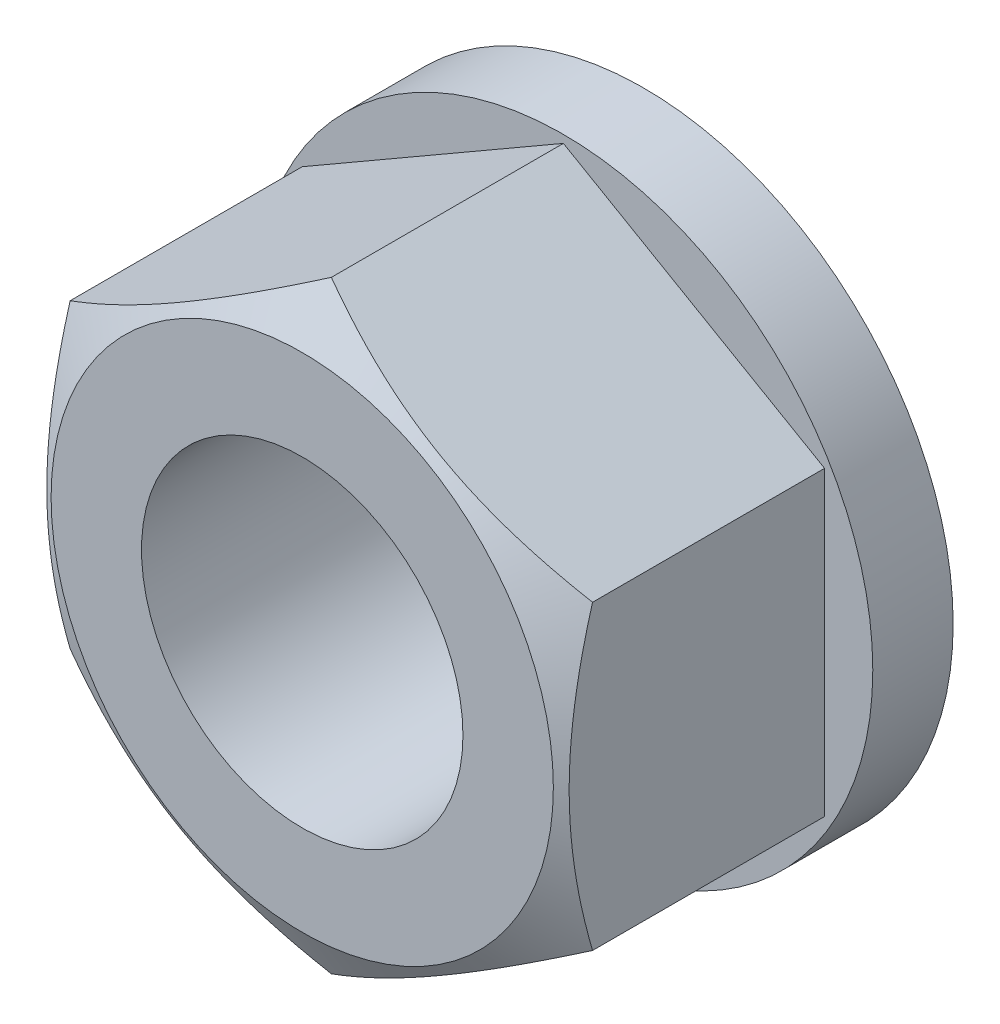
ISO-10303-21;
HEADER;
FILE_DESCRIPTION(('STEP AP214'),'2;1');
FILE_NAME('part.step','',(''),(''),'','','');
FILE_SCHEMA(('AUTOMOTIVE_DESIGN { 1 0 10303 214 1 1 1 1 }'));
ENDSEC;
DATA;
#1=APPLICATION_CONTEXT('core data for automotive mechanical design processes');
#2=APPLICATION_PROTOCOL_DEFINITION('international standard','automotive_design',2000,#1);
#3=PRODUCT_CONTEXT('',#1,'mechanical');
#4=PRODUCT('Part','Part','',(#3));
#5=PRODUCT_RELATED_PRODUCT_CATEGORY('part','',(#4));
#6=PRODUCT_DEFINITION_FORMATION('','',#4);
#7=PRODUCT_DEFINITION_CONTEXT('part definition',#1,'design');
#8=PRODUCT_DEFINITION('design','',#6,#7);
#9=PRODUCT_DEFINITION_SHAPE('','',#8);
#10=(LENGTH_UNIT() NAMED_UNIT(*) SI_UNIT(.MILLI.,.METRE.));
#11=(NAMED_UNIT(*) PLANE_ANGLE_UNIT() SI_UNIT($,.RADIAN.));
#12=(NAMED_UNIT(*) SI_UNIT($,.STERADIAN.) SOLID_ANGLE_UNIT());
#13=UNCERTAINTY_MEASURE_WITH_UNIT(LENGTH_MEASURE(1.E-05),#10,'distance_accuracy_value','');
#14=(GEOMETRIC_REPRESENTATION_CONTEXT(3) GLOBAL_UNCERTAINTY_ASSIGNED_CONTEXT((#13)) GLOBAL_UNIT_ASSIGNED_CONTEXT((#10,
#11,#12)) REPRESENTATION_CONTEXT('',''));
#15=CARTESIAN_POINT('',(0.,0.,0.));
#16=DIRECTION('',(0.,0.,1.));
#17=DIRECTION('',(1.,0.,0.));
#18=AXIS2_PLACEMENT_3D('',#15,#16,#17);
#19=CARTESIAN_POINT('',(0.,0.,2.));
#20=DIRECTION('',(0.,0.,1.));
#21=DIRECTION('',(1.,0.,0.));
#22=AXIS2_PLACEMENT_3D('',#19,#20,#21);
#23=PLANE('',#22);
#24=CARTESIAN_POINT('',(0.,0.,2.));
#25=DIRECTION('',(0.,0.,1.));
#26=DIRECTION('',(1.,0.,0.));
#27=AXIS2_PLACEMENT_3D('',#24,#25,#26);
#28=CIRCLE('',#27,7.7);
#29=CARTESIAN_POINT('',(7.7,0.,2.));
#30=VERTEX_POINT('',#29);
#31=EDGE_CURVE('E28',#30,#30,#28,.T.);
#32=ORIENTED_EDGE('',*,*,#31,.T.);
#33=EDGE_LOOP('',(#32));
#34=FACE_BOUND('',#33,.T.);
#35=DIRECTION('',(-0.866025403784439,0.5,0.));
#36=VECTOR('',#35,1.);
#37=CARTESIAN_POINT('',(6.5,3.75277674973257,2.));
#38=LINE('',#37,#36);
#39=CARTESIAN_POINT('',(6.5,3.75277674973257,2.));
#40=VERTEX_POINT('',#39);
#41=CARTESIAN_POINT('',(0.,7.50555349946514,2.));
#42=VERTEX_POINT('',#41);
#43=EDGE_CURVE('E86',#40,#42,#38,.T.);
#44=ORIENTED_EDGE('',*,*,#43,.F.);
#45=DIRECTION('',(0.,1.,0.));
#46=VECTOR('',#45,1.);
#47=CARTESIAN_POINT('',(6.5,-3.75277674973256,2.));
#48=LINE('',#47,#46);
#49=CARTESIAN_POINT('',(6.5,-3.75277674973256,2.));
#50=VERTEX_POINT('',#49);
#51=EDGE_CURVE('E305',#50,#40,#48,.T.);
#52=ORIENTED_EDGE('',*,*,#51,.F.);
#53=DIRECTION('',(0.866025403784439,0.5,0.));
#54=VECTOR('',#53,1.);
#55=CARTESIAN_POINT('',(0.,-7.50555349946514,2.));
#56=LINE('',#55,#54);
#57=CARTESIAN_POINT('',(0.,-7.50555349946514,2.));
#58=VERTEX_POINT('',#57);
#59=EDGE_CURVE('E302',#58,#50,#56,.T.);
#60=ORIENTED_EDGE('',*,*,#59,.F.);
#61=DIRECTION('',(0.866025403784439,-0.5,0.));
#62=VECTOR('',#61,1.);
#63=CARTESIAN_POINT('',(-6.5,-3.75277674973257,2.));
#64=LINE('',#63,#62);
#65=CARTESIAN_POINT('',(-6.5,-3.75277674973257,2.));
#66=VERTEX_POINT('',#65);
#67=EDGE_CURVE('E299',#66,#58,#64,.T.);
#68=ORIENTED_EDGE('',*,*,#67,.F.);
#69=DIRECTION('',(0.,-1.,0.));
#70=VECTOR('',#69,1.);
#71=CARTESIAN_POINT('',(-6.5,3.75277674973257,2.));
#72=LINE('',#71,#70);
#73=CARTESIAN_POINT('',(-6.5,3.75277674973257,2.));
#74=VERTEX_POINT('',#73);
#75=EDGE_CURVE('E296',#74,#66,#72,.T.);
#76=ORIENTED_EDGE('',*,*,#75,.F.);
#77=DIRECTION('',(-0.866025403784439,-0.5,0.));
#78=VECTOR('',#77,1.);
#79=CARTESIAN_POINT('',(0.,7.50555349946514,2.));
#80=LINE('',#79,#78);
#81=EDGE_CURVE('E294',#42,#74,#80,.T.);
#82=ORIENTED_EDGE('',*,*,#81,.F.);
#83=EDGE_LOOP('',(#44,#52,#60,#68,#76,#82));
#84=FACE_BOUND('',#83,.T.);
#85=ADVANCED_FACE('F14',(#34,#84),#23,.T.);
#86=CARTESIAN_POINT('',(0.,0.,0.));
#87=DIRECTION('',(0.,0.,1.));
#88=DIRECTION('',(1.,0.,0.));
#89=AXIS2_PLACEMENT_3D('',#86,#87,#88);
#90=PLANE('',#89);
#91=CARTESIAN_POINT('',(0.,0.,0.));
#92=DIRECTION('',(0.,0.,1.));
#93=DIRECTION('',(1.,0.,0.));
#94=AXIS2_PLACEMENT_3D('',#91,#92,#93);
#95=CIRCLE('',#94,7.7);
#96=CARTESIAN_POINT('',(7.7,0.,0.));
#97=VERTEX_POINT('',#96);
#98=EDGE_CURVE('E103',#97,#97,#95,.T.);
#99=ORIENTED_EDGE('',*,*,#98,.F.);
#100=EDGE_LOOP('',(#99));
#101=FACE_BOUND('',#100,.T.);
#102=CARTESIAN_POINT('',(0.,0.,0.));
#103=DIRECTION('',(0.,0.,1.));
#104=DIRECTION('',(1.,0.,0.));
#105=AXIS2_PLACEMENT_3D('',#102,#103,#104);
#106=CIRCLE('',#105,4.1);
#107=CARTESIAN_POINT('',(4.1,0.,0.));
#108=VERTEX_POINT('',#107);
#109=EDGE_CURVE('E100',#108,#108,#106,.T.);
#110=ORIENTED_EDGE('',*,*,#109,.T.);
#111=EDGE_LOOP('',(#110));
#112=FACE_BOUND('',#111,.T.);
#113=ADVANCED_FACE('F115',(#101,#112),#90,.F.);
#114=CARTESIAN_POINT('',(0.,0.,2.));
#115=DIRECTION('',(0.,0.,-1.));
#116=DIRECTION('',(-1.,0.,0.));
#117=AXIS2_PLACEMENT_3D('',#114,#115,#116);
#118=CYLINDRICAL_SURFACE('',#117,7.7);
#119=ORIENTED_EDGE('',*,*,#31,.F.);
#120=EDGE_LOOP('',(#119));
#121=FACE_BOUND('',#120,.T.);
#122=ORIENTED_EDGE('',*,*,#98,.T.);
#123=EDGE_LOOP('',(#122));
#124=FACE_BOUND('',#123,.T.);
#125=ADVANCED_FACE('F16',(#121,#124),#118,.T.);
#126=CARTESIAN_POINT('',(0.,0.,2.));
#127=DIRECTION('',(0.,0.,-1.));
#128=DIRECTION('',(-1.,0.,0.));
#129=AXIS2_PLACEMENT_3D('',#126,#127,#128);
#130=CYLINDRICAL_SURFACE('',#129,4.1);
#131=CARTESIAN_POINT('',(0.,0.,2.));
#132=DIRECTION('',(0.,0.,1.));
#133=DIRECTION('',(1.,0.,0.));
#134=AXIS2_PLACEMENT_3D('',#131,#132,#133);
#135=CIRCLE('',#134,4.1);
#136=CARTESIAN_POINT('',(4.1,0.,2.));
#137=VERTEX_POINT('',#136);
#138=EDGE_CURVE('E99',#137,#137,#135,.T.);
#139=ORIENTED_EDGE('',*,*,#138,.T.);
#140=EDGE_LOOP('',(#139));
#141=FACE_BOUND('',#140,.T.);
#142=ORIENTED_EDGE('',*,*,#109,.F.);
#143=EDGE_LOOP('',(#142));
#144=FACE_BOUND('',#143,.T.);
#145=ADVANCED_FACE('F114',(#141,#144),#130,.F.);
#146=CARTESIAN_POINT('',(-5.49926131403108,9.525,8.5));
#147=DIRECTION('',(0.,0.,1.));
#148=DIRECTION('',(1.,0.,0.));
#149=AXIS2_PLACEMENT_3D('',#146,#147,#148);
#150=PLANE('',#149);
#151=CARTESIAN_POINT('',(0.,0.,8.5));
#152=DIRECTION('',(0.,0.,-1.));
#153=DIRECTION('',(-1.,0.,0.));
#154=AXIS2_PLACEMENT_3D('',#151,#152,#153);
#155=CIRCLE('',#154,6.25);
#156=CARTESIAN_POINT('',(-6.25,0.,8.5));
#157=VERTEX_POINT('',#156);
#158=EDGE_CURVE('E82',#157,#157,#155,.T.);
#159=ORIENTED_EDGE('',*,*,#158,.F.);
#160=EDGE_LOOP('',(#159));
#161=FACE_BOUND('',#160,.T.);
#162=CARTESIAN_POINT('',(0.,0.,8.5));
#163=DIRECTION('',(0.,0.,1.));
#164=DIRECTION('',(1.,0.,0.));
#165=AXIS2_PLACEMENT_3D('',#162,#163,#164);
#166=CIRCLE('',#165,4.);
#167=CARTESIAN_POINT('',(4.,0.,8.5));
#168=VERTEX_POINT('',#167);
#169=EDGE_CURVE('E88',#168,#168,#166,.T.);
#170=ORIENTED_EDGE('',*,*,#169,.F.);
#171=EDGE_LOOP('',(#170));
#172=FACE_BOUND('',#171,.T.);
#173=ADVANCED_FACE('F124',(#161,#172),#150,.T.);
#174=CARTESIAN_POINT('',(-5.49926131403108,9.525,2.));
#175=DIRECTION('',(0.,0.,1.));
#176=DIRECTION('',(1.,0.,0.));
#177=AXIS2_PLACEMENT_3D('',#174,#175,#176);
#178=PLANE('',#177);
#179=CARTESIAN_POINT('',(0.,0.,2.));
#180=DIRECTION('',(0.,0.,1.));
#181=DIRECTION('',(1.,0.,0.));
#182=AXIS2_PLACEMENT_3D('',#179,#180,#181);
#183=CIRCLE('',#182,4.);
#184=CARTESIAN_POINT('',(4.,0.,2.));
#185=VERTEX_POINT('',#184);
#186=EDGE_CURVE('E91',#185,#185,#183,.T.);
#187=ORIENTED_EDGE('',*,*,#186,.T.);
#188=EDGE_LOOP('',(#187));
#189=FACE_BOUND('',#188,.T.);
#190=ORIENTED_EDGE('',*,*,#138,.F.);
#191=EDGE_LOOP('',(#190));
#192=FACE_BOUND('',#191,.T.);
#193=ADVANCED_FACE('F132',(#189,#192),#178,.F.);
#194=CARTESIAN_POINT('',(0.,0.,2.));
#195=DIRECTION('',(0.,0.,1.));
#196=DIRECTION('',(1.,0.,0.));
#197=AXIS2_PLACEMENT_3D('',#194,#195,#196);
#198=CYLINDRICAL_SURFACE('',#197,4.);
#199=ORIENTED_EDGE('',*,*,#186,.F.);
#200=EDGE_LOOP('',(#199));
#201=FACE_BOUND('',#200,.T.);
#202=ORIENTED_EDGE('',*,*,#169,.T.);
#203=EDGE_LOOP('',(#202));
#204=FACE_BOUND('',#203,.T.);
#205=ADVANCED_FACE('F172',(#201,#204),#198,.F.);
#206=CARTESIAN_POINT('',(6.5,-3.75277674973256,28.3578280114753));
#207=DIRECTION('',(-1.,0.,0.));
#208=DIRECTION('',(0.,0.,1.));
#209=AXIS2_PLACEMENT_3D('',#206,#207,#208);
#210=PLANE('',#209);
#211=DIRECTION('',(0.,0.,-1.));
#212=VECTOR('',#211,1.);
#213=CARTESIAN_POINT('',(6.5,3.75277674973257,28.3578280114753));
#214=LINE('',#213,#212);
#215=CARTESIAN_POINT('',(6.5,3.75277674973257,7.77510584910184));
#216=VERTEX_POINT('',#215);
#217=EDGE_CURVE('E41',#216,#40,#214,.T.);
#218=ORIENTED_EDGE('',*,*,#217,.F.);
#219=CARTESIAN_POINT('',(6.5,-10.0315093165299,5.20720308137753));
#220=CARTESIAN_POINT('',(6.5,-9.74801627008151,5.34452523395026));
#221=CARTESIAN_POINT('',(6.5,-9.46386715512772,5.48051644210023));
#222=CARTESIAN_POINT('',(6.5,-8.89390770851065,5.74908741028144));
#223=CARTESIAN_POINT('',(6.5,-8.608097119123,5.88166662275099));
#224=CARTESIAN_POINT('',(6.5,-8.0329694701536,6.14334153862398));
#225=CARTESIAN_POINT('',(6.5,-7.7436417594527,6.27241391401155));
#226=CARTESIAN_POINT('',(6.5,-7.16266788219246,6.52521072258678));
#227=CARTESIAN_POINT('',(6.5,-6.87102182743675,6.64893541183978));
#228=CARTESIAN_POINT('',(6.5,-6.27572812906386,6.89340953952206));
#229=CARTESIAN_POINT('',(6.5,-5.97199138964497,7.01394322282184));
#230=CARTESIAN_POINT('',(6.5,-5.36094607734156,7.24576901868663));
#231=CARTESIAN_POINT('',(6.5,-5.05363710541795,7.35706008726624));
#232=CARTESIAN_POINT('',(6.5,-4.43555080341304,7.56744350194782));
#233=CARTESIAN_POINT('',(6.5,-4.12478211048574,7.66656097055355));
#234=CARTESIAN_POINT('',(6.5,-3.49878421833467,7.84938327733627));
#235=CARTESIAN_POINT('',(6.5,-3.18355647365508,7.93309302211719));
#236=CARTESIAN_POINT('',(6.5,-2.55021520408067,8.08061249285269));
#237=CARTESIAN_POINT('',(6.5,-2.23212675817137,8.14452815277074));
#238=CARTESIAN_POINT('',(6.5,-1.59200127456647,8.24879698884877));
#239=CARTESIAN_POINT('',(6.5,-1.26996459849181,8.28915230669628));
#240=CARTESIAN_POINT('',(6.5,-0.787367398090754,8.32933416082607));
#241=CARTESIAN_POINT('',(6.5,-0.627613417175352,8.33933572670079));
#242=CARTESIAN_POINT('',(6.5,-0.307818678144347,8.35258343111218));
#243=CARTESIAN_POINT('',(6.5,-0.147777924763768,8.35582968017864));
#244=CARTESIAN_POINT('',(6.5,0.172296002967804,8.35548183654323));
#245=CARTESIAN_POINT('',(6.5,0.332329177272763,8.35188770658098));
#246=CARTESIAN_POINT('',(6.5,0.652103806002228,8.33794811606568));
#247=CARTESIAN_POINT('',(6.5,0.81184524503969,8.32760230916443));
#248=CARTESIAN_POINT('',(6.5,1.19724656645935,8.29471311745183));
#249=CARTESIAN_POINT('',(6.5,1.42263168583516,8.26888313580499));
#250=CARTESIAN_POINT('',(6.5,1.87168626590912,8.20520221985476));
#251=CARTESIAN_POINT('',(6.5,2.09535548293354,8.1673496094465));
#252=CARTESIAN_POINT('',(6.5,2.76355748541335,8.03776860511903));
#253=CARTESIAN_POINT('',(6.5,3.20502644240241,7.93004194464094));
#254=CARTESIAN_POINT('',(6.5,3.86507919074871,7.74377465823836));
#255=CARTESIAN_POINT('',(6.5,4.087100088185,7.67671784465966));
#256=CARTESIAN_POINT('',(6.5,4.52898454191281,7.53577428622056));
#257=CARTESIAN_POINT('',(6.5,4.74884808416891,7.46188749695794));
#258=CARTESIAN_POINT('',(6.5,5.18648963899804,7.30845824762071));
#259=CARTESIAN_POINT('',(6.5,5.40426834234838,7.22891773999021));
#260=CARTESIAN_POINT('',(6.5,5.8380304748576,7.06510346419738));
#261=CARTESIAN_POINT('',(6.5,6.05401392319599,6.98082974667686));
#262=CARTESIAN_POINT('',(6.5,6.55608723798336,6.77959988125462));
#263=CARTESIAN_POINT('',(6.5,6.84156084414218,6.66110917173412));
#264=CARTESIAN_POINT('',(6.5,7.41014703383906,6.41857658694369));
#265=CARTESIAN_POINT('',(6.5,7.69325948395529,6.29453440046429));
#266=CARTESIAN_POINT('',(6.5,8.25754778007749,6.04199250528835));
#267=CARTESIAN_POINT('',(6.5,8.53872325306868,5.91349196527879));
#268=CARTESIAN_POINT('',(6.5,9.09941194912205,5.6529079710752));
#269=CARTESIAN_POINT('',(6.5,9.37892513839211,5.52082444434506));
#270=CARTESIAN_POINT('',(6.5,9.93683305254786,5.2536023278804));
#271=CARTESIAN_POINT('',(6.5,10.2152263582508,5.11846077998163));
#272=CARTESIAN_POINT('',(6.5,10.7708287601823,4.84576275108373));
#273=CARTESIAN_POINT('',(6.5,11.0480378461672,4.70820624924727));
#274=CARTESIAN_POINT('',(6.5,11.8780980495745,4.29257995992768));
#275=CARTESIAN_POINT('',(6.5,12.4294517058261,4.01151978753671));
#276=CARTESIAN_POINT('',(6.5,13.4843994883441,3.46690758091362));
#277=CARTESIAN_POINT('',(6.5,13.9882222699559,3.20379652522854));
#278=CARTESIAN_POINT('',(6.5,14.9939907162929,2.67397363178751));
#279=CARTESIAN_POINT('',(6.5,15.4959363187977,2.4072616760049));
#280=CARTESIAN_POINT('',(6.5,16.4971678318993,1.87172384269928));
#281=CARTESIAN_POINT('',(6.5,16.9964572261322,1.60290446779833));
#282=CARTESIAN_POINT('',(6.5,17.9938313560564,1.06310156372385));
#283=CARTESIAN_POINT('',(6.5,18.4919161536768,0.792118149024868));
#284=CARTESIAN_POINT('',(6.5,18.9895553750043,0.520324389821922));
#285=B_SPLINE_CURVE_WITH_KNOTS('',3,(#219,#220,#221,#222,#223,#224,#225,#226,#227,#228,#229,
#230,#231,#232,#233,#234,#235,#236,#237,#238,#239,#240,#241,#242,#243,#244,#245,#246,#247,#248,
#249,#250,#251,#252,#253,#254,#255,#256,#257,#258,#259,#260,#261,#262,#263,#264,#265,#266,#267,
#268,#269,#270,#271,#272,#273,#274,#275,#276,#277,#278,#279,#280,#281,#282,#283,#284),
.UNSPECIFIED.,.F.,.F.,(4,2,2,2,2,2,2,2,2,2,2,2,2,2,2,2,2,2,2,2,2,2,2,2,2,2,2,2,2,2,2,2,4),(0.,
0.945015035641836,1.89018079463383,2.84057519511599,3.79092403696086,4.77114430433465,
5.75147514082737,6.72974761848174,7.70770802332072,8.68034033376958,9.65288421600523,
10.1329633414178,10.6130346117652,11.093108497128,11.5732070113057,12.253402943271,
12.9336937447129,14.2950500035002,14.990773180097,15.6865008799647,16.3819894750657,
17.0774706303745,18.0046555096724,18.9318924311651,19.8593031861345,20.7867327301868,
21.7151014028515,22.6434780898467,24.4999996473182,26.2051478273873,27.9103520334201,
29.6115176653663,31.3125938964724),.UNSPECIFIED.);
#286=CARTESIAN_POINT('',(6.5,-3.75277674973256,7.77510584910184));
#287=VERTEX_POINT('',#286);
#288=EDGE_CURVE('E35',#216,#287,#285,.F.);
#289=ORIENTED_EDGE('',*,*,#288,.T.);
#290=DIRECTION('',(0.,0.,-1.));
#291=VECTOR('',#290,1.);
#292=CARTESIAN_POINT('',(6.5,-3.75277674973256,28.3578280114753));
#293=LINE('',#292,#291);
#294=EDGE_CURVE('E308',#287,#50,#293,.T.);
#295=ORIENTED_EDGE('',*,*,#294,.T.);
#296=ORIENTED_EDGE('',*,*,#51,.T.);
#297=EDGE_LOOP('',(#218,#289,#295,#296));
#298=FACE_BOUND('',#297,.T.);
#299=ADVANCED_FACE('F180',(#298),#210,.F.);
#300=CARTESIAN_POINT('',(0.,-7.50555349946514,28.3578280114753));
#301=DIRECTION('',(-0.5,0.866025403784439,0.));
#302=DIRECTION('',(-0.866025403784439,-0.5,0.));
#303=AXIS2_PLACEMENT_3D('',#300,#301,#302);
#304=PLANE('',#303);
#305=ORIENTED_EDGE('',*,*,#294,.F.);
#306=CARTESIAN_POINT('',(6.5002,-3.75266127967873,7.77503918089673));
#307=CARTESIAN_POINT('',(6.35732254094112,-3.83515161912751,7.82265800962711));
#308=CARTESIAN_POINT('',(6.21391236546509,-3.91794952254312,7.86811573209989));
#309=CARTESIAN_POINT('',(5.92592736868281,-4.08421773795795,7.95411375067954));
#310=CARTESIAN_POINT('',(5.78135207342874,-4.16768832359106,7.99465192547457));
#311=CARTESIAN_POINT('',(5.34531134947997,-4.41943655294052,8.10809143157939));
#312=CARTESIAN_POINT('',(5.05212471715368,-4.5887079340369,8.17261462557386));
#313=CARTESIAN_POINT('',(4.61337625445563,-4.84201947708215,8.2482758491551));
#314=CARTESIAN_POINT('',(4.46912536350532,-4.92530276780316,8.2698295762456));
#315=CARTESIAN_POINT('',(4.17997178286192,-5.09224566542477,8.30597211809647));
#316=CARTESIAN_POINT('',(4.03506915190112,-5.17590523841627,8.32056154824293));
#317=CARTESIAN_POINT('',(3.74501222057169,-5.34336968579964,8.34240368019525));
#318=CARTESIAN_POINT('',(3.5998583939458,-5.427174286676,8.34966470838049));
#319=CARTESIAN_POINT('',(3.30942466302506,-5.59485627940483,8.35670213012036));
#320=CARTESIAN_POINT('',(3.16414476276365,-5.6787336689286,8.35647875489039));
#321=CARTESIAN_POINT('',(2.76612405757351,-5.90853103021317,8.34557897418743));
#322=CARTESIAN_POINT('',(2.51351353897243,-6.05437578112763,8.32728061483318));
#323=CARTESIAN_POINT('',(2.00997032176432,-6.34509659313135,8.26925609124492));
#324=CARTESIAN_POINT('',(1.75903939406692,-6.48997163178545,8.22951009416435));
#325=CARTESIAN_POINT('',(1.25448277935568,-6.78127752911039,8.13015652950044));
#326=CARTESIAN_POINT('',(1.00092075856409,-6.92767163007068,8.07012800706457));
#327=CARTESIAN_POINT('',(0.497578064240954,-7.21827667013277,7.93388744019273));
#328=CARTESIAN_POINT('',(0.247790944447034,-7.36249133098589,7.857707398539));
#329=CARTESIAN_POINT('',(-0.000200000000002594,-7.50566896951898,7.77503918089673));
#330=B_SPLINE_CURVE_WITH_KNOTS('',3,(#306,#307,#308,#309,#310,#311,#312,#313,#314,#315,#316,
#317,#318,#319,#320,#321,#322,#323,#324,#325,#326,#327,#328,#329),.UNSPECIFIED.,.F.,.F.,(4,2,2,
2,2,2,2,2,2,2,2,4),(0.,0.515105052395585,1.03043143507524,2.06322554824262,2.56697389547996,
3.07067772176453,3.57380860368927,4.07692394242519,4.9527935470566,5.82947446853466,
6.72559912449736,7.61996451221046),.UNSPECIFIED.);
#331=CARTESIAN_POINT('',(0.,-7.50555349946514,7.77510584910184));
#332=VERTEX_POINT('',#331);
#333=EDGE_CURVE('E277',#287,#332,#330,.T.);
#334=ORIENTED_EDGE('',*,*,#333,.T.);
#335=DIRECTION('',(0.,0.,-1.));
#336=VECTOR('',#335,1.);
#337=CARTESIAN_POINT('',(0.,-7.50555349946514,28.3578280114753));
#338=LINE('',#337,#336);
#339=EDGE_CURVE('E310',#332,#58,#338,.T.);
#340=ORIENTED_EDGE('',*,*,#339,.T.);
#341=ORIENTED_EDGE('',*,*,#59,.T.);
#342=EDGE_LOOP('',(#305,#334,#340,#341));
#343=FACE_BOUND('',#342,.T.);
#344=ADVANCED_FACE('F188',(#343),#304,.F.);
#345=CARTESIAN_POINT('',(-6.5,-3.75277674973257,28.3578280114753));
#346=DIRECTION('',(0.5,0.866025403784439,0.));
#347=DIRECTION('',(-0.866025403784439,0.5,0.));
#348=AXIS2_PLACEMENT_3D('',#345,#346,#347);
#349=PLANE('',#348);
#350=ORIENTED_EDGE('',*,*,#339,.F.);
#351=CARTESIAN_POINT('',(0.00019999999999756,-7.50566896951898,7.77503918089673));
#352=CARTESIAN_POINT('',(-0.142677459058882,-7.4231786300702,7.82265800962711));
#353=CARTESIAN_POINT('',(-0.286087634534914,-7.34038072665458,7.86811573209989));
#354=CARTESIAN_POINT('',(-0.574072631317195,-7.17411251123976,7.95411375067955));
#355=CARTESIAN_POINT('',(-0.718647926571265,-7.09064192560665,7.99465192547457));
#356=CARTESIAN_POINT('',(-1.15468865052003,-6.83889369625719,8.10809143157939));
#357=CARTESIAN_POINT('',(-1.44787528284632,-6.66962231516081,8.17261462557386));
#358=CARTESIAN_POINT('',(-1.88662374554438,-6.41631077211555,8.2482758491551));
#359=CARTESIAN_POINT('',(-2.03087463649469,-6.33302748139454,8.26982957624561));
#360=CARTESIAN_POINT('',(-2.32002821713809,-6.16608458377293,8.30597211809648));
#361=CARTESIAN_POINT('',(-2.46493084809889,-6.08242501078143,8.32056154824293));
#362=CARTESIAN_POINT('',(-2.75498777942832,-5.91496056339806,8.34240368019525));
#363=CARTESIAN_POINT('',(-2.90014160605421,-5.8311559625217,8.34966470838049));
#364=CARTESIAN_POINT('',(-3.19057533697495,-5.66347396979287,8.35670213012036));
#365=CARTESIAN_POINT('',(-3.33585523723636,-5.5795965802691,8.35647875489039));
#366=CARTESIAN_POINT('',(-3.7338759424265,-5.34979921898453,8.34557897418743));
#367=CARTESIAN_POINT('',(-3.98648646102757,-5.20395446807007,8.32728061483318));
#368=CARTESIAN_POINT('',(-4.49002967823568,-4.91323365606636,8.26925609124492));
#369=CARTESIAN_POINT('',(-4.74096060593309,-4.76835861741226,8.22951009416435));
#370=CARTESIAN_POINT('',(-5.24551722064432,-4.47705272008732,8.13015652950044));
#371=CARTESIAN_POINT('',(-5.49907924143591,-4.33065861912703,8.07012800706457));
#372=CARTESIAN_POINT('',(-6.00242193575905,-4.04005357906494,7.93388744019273));
#373=CARTESIAN_POINT('',(-6.25220905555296,-3.89583891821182,7.857707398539));
#374=CARTESIAN_POINT('',(-6.5002,-3.75266127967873,7.77503918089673));
#375=B_SPLINE_CURVE_WITH_KNOTS('',3,(#351,#352,#353,#354,#355,#356,#357,#358,#359,#360,#361,
#362,#363,#364,#365,#366,#367,#368,#369,#370,#371,#372,#373,#374),.UNSPECIFIED.,.F.,.F.,(4,2,2,
2,2,2,2,2,2,2,2,4),(0.,0.515105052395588,1.03043143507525,2.06322554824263,2.56697389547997,
3.07067772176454,3.57380860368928,4.07692394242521,4.9527935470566,5.82947446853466,
6.72559912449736,7.61996451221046),.UNSPECIFIED.);
#376=CARTESIAN_POINT('',(-6.5,-3.75277674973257,7.77510584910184));
#377=VERTEX_POINT('',#376);
#378=EDGE_CURVE('E271',#332,#377,#375,.T.);
#379=ORIENTED_EDGE('',*,*,#378,.T.);
#380=DIRECTION('',(0.,0.,-1.));
#381=VECTOR('',#380,1.);
#382=CARTESIAN_POINT('',(-6.5,-3.75277674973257,28.3578280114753));
#383=LINE('',#382,#381);
#384=EDGE_CURVE('E93',#377,#66,#383,.T.);
#385=ORIENTED_EDGE('',*,*,#384,.T.);
#386=ORIENTED_EDGE('',*,*,#67,.T.);
#387=EDGE_LOOP('',(#350,#379,#385,#386));
#388=FACE_BOUND('',#387,.T.);
#389=ADVANCED_FACE('F196',(#388),#349,.F.);
#390=CARTESIAN_POINT('',(-6.5,3.75277674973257,28.3578280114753));
#391=DIRECTION('',(1.,0.,0.));
#392=DIRECTION('',(0.,1.,0.));
#393=AXIS2_PLACEMENT_3D('',#390,#391,#392);
#394=PLANE('',#393);
#395=ORIENTED_EDGE('',*,*,#384,.F.);
#396=CARTESIAN_POINT('',(-6.5,-10.0315093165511,5.20720308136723));
#397=CARTESIAN_POINT('',(-6.5,-9.74801627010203,5.34452523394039));
#398=CARTESIAN_POINT('',(-6.5,-9.46386715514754,5.48051644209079));
#399=CARTESIAN_POINT('',(-6.5,-8.89390770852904,5.74908741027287));
#400=CARTESIAN_POINT('',(-6.5,-8.60809711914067,5.88166662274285));
#401=CARTESIAN_POINT('',(-6.5,-8.03296947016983,6.1433415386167));
#402=CARTESIAN_POINT('',(-6.5,-7.7436417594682,6.2724139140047));
#403=CARTESIAN_POINT('',(-6.5,-7.16266788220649,6.52521072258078));
#404=CARTESIAN_POINT('',(-6.5,-6.87102182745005,6.6489354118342));
#405=CARTESIAN_POINT('',(-6.5,-6.27572812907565,6.89340953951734));
#406=CARTESIAN_POINT('',(-6.5,-5.97199138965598,7.01394322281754));
#407=CARTESIAN_POINT('',(-6.5,-5.36094607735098,7.24576901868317));
#408=CARTESIAN_POINT('',(-6.5,-5.05363710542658,7.35706008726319));
#409=CARTESIAN_POINT('',(-6.5,-4.43555080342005,7.56744350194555));
#410=CARTESIAN_POINT('',(-6.5,-4.12478211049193,7.66656097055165));
#411=CARTESIAN_POINT('',(-6.5,-3.49878421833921,7.84938327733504));
#412=CARTESIAN_POINT('',(-6.5,-3.18355647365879,7.93309302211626));
#413=CARTESIAN_POINT('',(-6.5,-2.55021520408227,8.08061249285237));
#414=CARTESIAN_POINT('',(-6.5,-2.23212675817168,8.14452815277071));
#415=CARTESIAN_POINT('',(-6.5,-1.59200127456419,8.24879698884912));
#416=CARTESIAN_POINT('',(-6.5,-1.26996459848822,8.28915230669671));
#417=CARTESIAN_POINT('',(-6.5,-0.787367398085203,8.32933416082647));
#418=CARTESIAN_POINT('',(-6.5,-0.627613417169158,8.33933572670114));
#419=CARTESIAN_POINT('',(-6.5,-0.307818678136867,8.35258343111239));
#420=CARTESIAN_POINT('',(-6.5,-0.147777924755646,8.35582968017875));
#421=CARTESIAN_POINT('',(-6.5,0.172296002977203,8.3554818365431));
#422=CARTESIAN_POINT('',(-6.5,0.332329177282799,8.35188770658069));
#423=CARTESIAN_POINT('',(-6.5,0.65210380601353,8.33794811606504));
#424=CARTESIAN_POINT('',(-6.5,0.811845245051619,8.32760230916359));
#425=CARTESIAN_POINT('',(-6.5,1.19724656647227,8.29471311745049));
#426=CARTESIAN_POINT('',(-6.5,1.42263168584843,8.26888313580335));
#427=CARTESIAN_POINT('',(-6.5,1.8716862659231,8.20520221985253));
#428=CARTESIAN_POINT('',(-6.5,2.09535548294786,8.16734960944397));
#429=CARTESIAN_POINT('',(-6.5,2.76355748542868,8.03776860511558));
#430=CARTESIAN_POINT('',(-6.5,3.20502644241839,7.93004194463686));
#431=CARTESIAN_POINT('',(-6.5,3.86507919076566,7.74377465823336));
#432=CARTESIAN_POINT('',(-6.5,4.08710008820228,7.67671784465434));
#433=CARTESIAN_POINT('',(-6.5,4.52898454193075,7.53577428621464));
#434=CARTESIAN_POINT('',(-6.5,4.74884808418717,7.46188749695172));
#435=CARTESIAN_POINT('',(-6.5,5.18648963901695,7.3084582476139));
#436=CARTESIAN_POINT('',(-6.5,5.40426834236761,7.22891773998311));
#437=CARTESIAN_POINT('',(-6.5,5.83803047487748,7.06510346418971));
#438=CARTESIAN_POINT('',(-6.5,6.05401392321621,6.9808297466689));
#439=CARTESIAN_POINT('',(-6.5,6.55608723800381,6.77959988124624));
#440=CARTESIAN_POINT('',(-6.5,6.84156084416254,6.6611091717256));
#441=CARTESIAN_POINT('',(-6.5,7.41014703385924,6.41857658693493));
#442=CARTESIAN_POINT('',(-6.5,7.69325948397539,6.29453440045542));
#443=CARTESIAN_POINT('',(-6.5,8.25754778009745,6.04199250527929));
#444=CARTESIAN_POINT('',(-6.5,8.53872325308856,5.91349196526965));
#445=CARTESIAN_POINT('',(-6.5,9.0994119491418,5.65290797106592));
#446=CARTESIAN_POINT('',(-6.5,9.37892513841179,5.52082444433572));
#447=CARTESIAN_POINT('',(-6.5,9.93683305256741,5.25360232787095));
#448=CARTESIAN_POINT('',(-6.5,10.2152263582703,5.11846077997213));
#449=CARTESIAN_POINT('',(-6.5,10.7708287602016,4.84576275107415));
#450=CARTESIAN_POINT('',(-6.5,11.0480378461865,4.70820624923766));
#451=CARTESIAN_POINT('',(-6.5,11.8780980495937,4.29257995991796));
#452=CARTESIAN_POINT('',(-6.5,12.4294517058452,4.01151978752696));
#453=CARTESIAN_POINT('',(-6.5,13.484399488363,3.46690758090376));
#454=CARTESIAN_POINT('',(-6.5,13.9882222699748,3.20379652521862));
#455=CARTESIAN_POINT('',(-6.5,14.9939907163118,2.67397363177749));
#456=CARTESIAN_POINT('',(-6.5,15.4959363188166,2.40726167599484));
#457=CARTESIAN_POINT('',(-6.5,16.4971678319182,1.87172384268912));
#458=CARTESIAN_POINT('',(-6.5,16.9964572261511,1.60290446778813));
#459=CARTESIAN_POINT('',(-6.5,17.9938313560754,1.06310156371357));
#460=CARTESIAN_POINT('',(-6.5,18.4919161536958,0.792118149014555));
#461=CARTESIAN_POINT('',(-6.5,18.9895553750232,0.520324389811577));
#462=B_SPLINE_CURVE_WITH_KNOTS('',3,(#396,#397,#398,#399,#400,#401,#402,#403,#404,#405,#406,
#407,#408,#409,#410,#411,#412,#413,#414,#415,#416,#417,#418,#419,#420,#421,#422,#423,#424,#425,
#426,#427,#428,#429,#430,#431,#432,#433,#434,#435,#436,#437,#438,#439,#440,#441,#442,#443,#444,
#445,#446,#447,#448,#449,#450,#451,#452,#453,#454,#455,#456,#457,#458,#459,#460,#461),
.UNSPECIFIED.,.F.,.F.,(4,2,2,2,2,2,2,2,2,2,2,2,2,2,2,2,2,2,2,2,2,2,2,2,2,2,2,2,2,2,2,2,4),(0.,
0.945015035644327,1.89018079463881,2.84057519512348,3.79092403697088,4.77114430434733,
5.75147514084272,6.72974761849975,7.70770802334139,8.68034033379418,9.65288421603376,
10.1329633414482,10.6130346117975,11.0931084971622,11.5732070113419,12.2534029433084,
12.9336937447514,14.2950500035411,14.9907731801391,15.6865008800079,16.3819894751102,
17.0774706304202,18.004655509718,18.9318924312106,19.8593031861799,20.7867327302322,
21.7151014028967,22.6434780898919,24.4999996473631,26.2051478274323,27.9103520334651,
29.6115176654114,31.3125938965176),.UNSPECIFIED.);
#463=CARTESIAN_POINT('',(-6.5,3.75277674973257,7.77510584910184));
#464=VERTEX_POINT('',#463);
#465=EDGE_CURVE('E81',#377,#464,#462,.T.);
#466=ORIENTED_EDGE('',*,*,#465,.T.);
#467=DIRECTION('',(0.,0.,-1.));
#468=VECTOR('',#467,1.);
#469=CARTESIAN_POINT('',(-6.5,3.75277674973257,28.3578280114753));
#470=LINE('',#469,#468);
#471=EDGE_CURVE('E80',#464,#74,#470,.T.);
#472=ORIENTED_EDGE('',*,*,#471,.T.);
#473=ORIENTED_EDGE('',*,*,#75,.T.);
#474=EDGE_LOOP('',(#395,#466,#472,#473));
#475=FACE_BOUND('',#474,.T.);
#476=ADVANCED_FACE('F204',(#475),#394,.F.);
#477=CARTESIAN_POINT('',(0.,7.50555349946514,28.3578280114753));
#478=DIRECTION('',(0.5,-0.866025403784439,0.));
#479=DIRECTION('',(0.866025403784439,0.5,0.));
#480=AXIS2_PLACEMENT_3D('',#477,#478,#479);
#481=PLANE('',#480);
#482=ORIENTED_EDGE('',*,*,#471,.F.);
#483=CARTESIAN_POINT('',(-6.5002,3.75266127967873,7.77503918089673));
#484=CARTESIAN_POINT('',(-6.35732254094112,3.83515161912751,7.82265800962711));
#485=CARTESIAN_POINT('',(-6.21391236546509,3.91794952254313,7.86811573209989));
#486=CARTESIAN_POINT('',(-5.92592736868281,4.08421773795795,7.95411375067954));
#487=CARTESIAN_POINT('',(-5.78135207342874,4.16768832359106,7.99465192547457));
#488=CARTESIAN_POINT('',(-5.34531134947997,4.41943655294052,8.10809143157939));
#489=CARTESIAN_POINT('',(-5.05212471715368,4.5887079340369,8.17261462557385));
#490=CARTESIAN_POINT('',(-4.61337625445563,4.84201947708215,8.2482758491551));
#491=CARTESIAN_POINT('',(-4.46912536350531,4.92530276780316,8.2698295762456));
#492=CARTESIAN_POINT('',(-4.17997178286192,5.09224566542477,8.30597211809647));
#493=CARTESIAN_POINT('',(-4.03506915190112,5.17590523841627,8.32056154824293));
#494=CARTESIAN_POINT('',(-3.74501222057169,5.34336968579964,8.34240368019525));
#495=CARTESIAN_POINT('',(-3.5998583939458,5.427174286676,8.34966470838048));
#496=CARTESIAN_POINT('',(-3.30942466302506,5.59485627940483,8.35670213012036));
#497=CARTESIAN_POINT('',(-3.16414476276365,5.6787336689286,8.35647875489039));
#498=CARTESIAN_POINT('',(-2.76612405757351,5.90853103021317,8.34557897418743));
#499=CARTESIAN_POINT('',(-2.51351353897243,6.05437578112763,8.32728061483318));
#500=CARTESIAN_POINT('',(-2.00997032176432,6.34509659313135,8.26925609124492));
#501=CARTESIAN_POINT('',(-1.75903939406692,6.48997163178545,8.22951009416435));
#502=CARTESIAN_POINT('',(-1.25448277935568,6.78127752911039,8.13015652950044));
#503=CARTESIAN_POINT('',(-1.00092075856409,6.92767163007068,8.07012800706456));
#504=CARTESIAN_POINT('',(-0.497578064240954,7.21827667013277,7.93388744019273));
#505=CARTESIAN_POINT('',(-0.247790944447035,7.36249133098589,7.857707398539));
#506=CARTESIAN_POINT('',(0.0002000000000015,7.50566896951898,7.77503918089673));
#507=B_SPLINE_CURVE_WITH_KNOTS('',3,(#483,#484,#485,#486,#487,#488,#489,#490,#491,#492,#493,
#494,#495,#496,#497,#498,#499,#500,#501,#502,#503,#504,#505,#506),.UNSPECIFIED.,.F.,.F.,(4,2,2,
2,2,2,2,2,2,2,2,4),(0.,0.515105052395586,1.03043143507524,2.06322554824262,2.56697389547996,
3.07067772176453,3.57380860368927,4.07692394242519,4.9527935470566,5.82947446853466,
6.72559912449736,7.61996451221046),.UNSPECIFIED.);
#508=CARTESIAN_POINT('',(0.,7.50555349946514,7.77510584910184));
#509=VERTEX_POINT('',#508);
#510=EDGE_CURVE('E72',#464,#509,#507,.T.);
#511=ORIENTED_EDGE('',*,*,#510,.T.);
#512=DIRECTION('',(0.,0.,-1.));
#513=VECTOR('',#512,1.);
#514=CARTESIAN_POINT('',(0.,7.50555349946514,28.3578280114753));
#515=LINE('',#514,#513);
#516=EDGE_CURVE('E79',#509,#42,#515,.T.);
#517=ORIENTED_EDGE('',*,*,#516,.T.);
#518=ORIENTED_EDGE('',*,*,#81,.T.);
#519=EDGE_LOOP('',(#482,#511,#517,#518));
#520=FACE_BOUND('',#519,.T.);
#521=ADVANCED_FACE('F77',(#520),#481,.F.);
#522=CARTESIAN_POINT('',(6.5,3.75277674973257,28.3578280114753));
#523=DIRECTION('',(-0.5,-0.866025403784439,0.));
#524=DIRECTION('',(0.866025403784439,-0.5,0.));
#525=AXIS2_PLACEMENT_3D('',#522,#523,#524);
#526=PLANE('',#525);
#527=ORIENTED_EDGE('',*,*,#516,.F.);
#528=CARTESIAN_POINT('',(-0.000199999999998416,7.50566896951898,7.77503918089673));
#529=CARTESIAN_POINT('',(0.14267745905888,7.4231786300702,7.82265800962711));
#530=CARTESIAN_POINT('',(0.286087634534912,7.34038072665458,7.86811573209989));
#531=CARTESIAN_POINT('',(0.574072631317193,7.17411251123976,7.95411375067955));
#532=CARTESIAN_POINT('',(0.718647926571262,7.09064192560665,7.99465192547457));
#533=CARTESIAN_POINT('',(1.15468865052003,6.83889369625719,8.10809143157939));
#534=CARTESIAN_POINT('',(1.44787528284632,6.66962231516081,8.17261462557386));
#535=CARTESIAN_POINT('',(1.88662374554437,6.41631077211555,8.2482758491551));
#536=CARTESIAN_POINT('',(2.03087463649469,6.33302748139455,8.2698295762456));
#537=CARTESIAN_POINT('',(2.32002821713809,6.16608458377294,8.30597211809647));
#538=CARTESIAN_POINT('',(2.46493084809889,6.08242501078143,8.32056154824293));
#539=CARTESIAN_POINT('',(2.75498777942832,5.91496056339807,8.34240368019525));
#540=CARTESIAN_POINT('',(2.90014160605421,5.8311559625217,8.34966470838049));
#541=CARTESIAN_POINT('',(3.19057533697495,5.66347396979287,8.35670213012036));
#542=CARTESIAN_POINT('',(3.33585523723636,5.57959658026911,8.35647875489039));
#543=CARTESIAN_POINT('',(3.73387594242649,5.34979921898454,8.34557897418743));
#544=CARTESIAN_POINT('',(3.98648646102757,5.20395446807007,8.32728061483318));
#545=CARTESIAN_POINT('',(4.49002967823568,4.91323365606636,8.26925609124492));
#546=CARTESIAN_POINT('',(4.74096060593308,4.76835861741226,8.22951009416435));
#547=CARTESIAN_POINT('',(5.24551722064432,4.47705272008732,8.13015652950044));
#548=CARTESIAN_POINT('',(5.49907924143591,4.33065861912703,8.07012800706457));
#549=CARTESIAN_POINT('',(6.00242193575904,4.04005357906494,7.93388744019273));
#550=CARTESIAN_POINT('',(6.25220905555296,3.89583891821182,7.857707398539));
#551=CARTESIAN_POINT('',(6.5002,3.75266127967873,7.77503918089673));
#552=B_SPLINE_CURVE_WITH_KNOTS('',3,(#528,#529,#530,#531,#532,#533,#534,#535,#536,#537,#538,
#539,#540,#541,#542,#543,#544,#545,#546,#547,#548,#549,#550,#551),.UNSPECIFIED.,.F.,.F.,(4,2,2,
2,2,2,2,2,2,2,2,4),(0.,0.515105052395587,1.03043143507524,2.06322554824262,2.56697389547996,
3.07067772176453,3.57380860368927,4.0769239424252,4.9527935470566,5.82947446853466,
6.72559912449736,7.61996451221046),.UNSPECIFIED.);
#553=EDGE_CURVE('E9',#509,#216,#552,.T.);
#554=ORIENTED_EDGE('',*,*,#553,.T.);
#555=ORIENTED_EDGE('',*,*,#217,.T.);
#556=ORIENTED_EDGE('',*,*,#43,.T.);
#557=EDGE_LOOP('',(#527,#554,#555,#556));
#558=FACE_BOUND('',#557,.T.);
#559=ADVANCED_FACE('F84',(#558),#526,.F.);
#560=CARTESIAN_POINT('',(0.,0.,8.5));
#561=DIRECTION('',(0.,0.,-1.));
#562=DIRECTION('',(-1.,0.,0.));
#563=AXIS2_PLACEMENT_3D('',#560,#561,#562);
#564=CONICAL_SURFACE('',#563,6.25,1.0471975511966);
#565=ORIENTED_EDGE('',*,*,#158,.T.);
#566=EDGE_LOOP('',(#565));
#567=FACE_BOUND('',#566,.T.);
#568=ORIENTED_EDGE('',*,*,#553,.F.);
#569=ORIENTED_EDGE('',*,*,#510,.F.);
#570=ORIENTED_EDGE('',*,*,#465,.F.);
#571=ORIENTED_EDGE('',*,*,#378,.F.);
#572=ORIENTED_EDGE('',*,*,#333,.F.);
#573=ORIENTED_EDGE('',*,*,#288,.F.);
#574=EDGE_LOOP('',(#568,#569,#570,#571,#572,#573));
#575=FACE_BOUND('',#574,.T.);
#576=ADVANCED_FACE('F71',(#567,#575),#564,.T.);
#577=CLOSED_SHELL('',(#85,#113,#125,#145,#173,#193,#205,#299,#344,#389,#476,#521,#559,#576));
#578=MANIFOLD_SOLID_BREP('B1',#577);
#579=ADVANCED_BREP_SHAPE_REPRESENTATION('',(#18,#578),#14);
#580=SHAPE_DEFINITION_REPRESENTATION(#9,#579);
ENDSEC;
END-ISO-10303-21;
